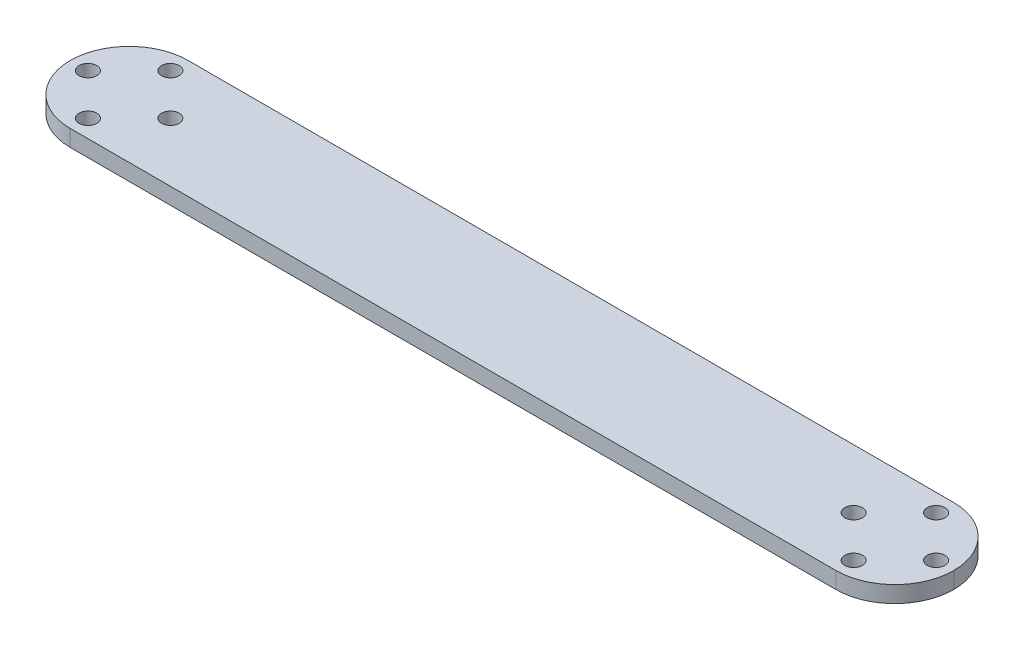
ISO-10303-21;
HEADER;
FILE_DESCRIPTION(('STEP AP214'),'2;1');
FILE_NAME('part.step','',(''),(''),'','','');
FILE_SCHEMA(('AUTOMOTIVE_DESIGN { 1 0 10303 214 1 1 1 1 }'));
ENDSEC;
DATA;
#1=APPLICATION_CONTEXT('core data for automotive mechanical design processes');
#2=APPLICATION_PROTOCOL_DEFINITION('international standard','automotive_design',2000,#1);
#3=PRODUCT_CONTEXT('',#1,'mechanical');
#4=PRODUCT('Part','Part','',(#3));
#5=PRODUCT_RELATED_PRODUCT_CATEGORY('part','',(#4));
#6=PRODUCT_DEFINITION_FORMATION('','',#4);
#7=PRODUCT_DEFINITION_CONTEXT('part definition',#1,'design');
#8=PRODUCT_DEFINITION('design','',#6,#7);
#9=PRODUCT_DEFINITION_SHAPE('','',#8);
#10=(LENGTH_UNIT() NAMED_UNIT(*) SI_UNIT(.MILLI.,.METRE.));
#11=(NAMED_UNIT(*) PLANE_ANGLE_UNIT() SI_UNIT($,.RADIAN.));
#12=(NAMED_UNIT(*) SI_UNIT($,.STERADIAN.) SOLID_ANGLE_UNIT());
#13=UNCERTAINTY_MEASURE_WITH_UNIT(LENGTH_MEASURE(1.E-05),#10,'distance_accuracy_value','');
#14=(GEOMETRIC_REPRESENTATION_CONTEXT(3) GLOBAL_UNCERTAINTY_ASSIGNED_CONTEXT((#13)) GLOBAL_UNIT_ASSIGNED_CONTEXT((#10,
#11,#12)) REPRESENTATION_CONTEXT('',''));
#15=CARTESIAN_POINT('',(0.,0.,0.));
#16=DIRECTION('',(0.,0.,1.));
#17=DIRECTION('',(1.,0.,0.));
#18=AXIS2_PLACEMENT_3D('',#15,#16,#17);
#19=CARTESIAN_POINT('',(0.,2.8,0.));
#20=DIRECTION('',(0.,0.,-1.));
#21=DIRECTION('',(-1.,0.,0.));
#22=AXIS2_PLACEMENT_3D('',#19,#20,#21);
#23=PLANE('',#22);
#24=DIRECTION('',(1.,0.,0.));
#25=VECTOR('',#24,1.);
#26=CARTESIAN_POINT('',(0.,2.8,0.));
#27=LINE('',#26,#25);
#28=CARTESIAN_POINT('',(10.,2.8,0.));
#29=VERTEX_POINT('',#28);
#30=CARTESIAN_POINT('',(140.,2.8,0.));
#31=VERTEX_POINT('',#30);
#32=EDGE_CURVE('E105',#29,#31,#27,.T.);
#33=ORIENTED_EDGE('',*,*,#32,.F.);
#34=DIRECTION('',(0.,-1.,0.));
#35=VECTOR('',#34,1.);
#36=CARTESIAN_POINT('',(10.,2.8,0.));
#37=LINE('',#36,#35);
#38=CARTESIAN_POINT('',(10.,0.,0.));
#39=VERTEX_POINT('',#38);
#40=EDGE_CURVE('E91',#29,#39,#37,.T.);
#41=ORIENTED_EDGE('',*,*,#40,.T.);
#42=DIRECTION('',(1.,0.,0.));
#43=VECTOR('',#42,1.);
#44=CARTESIAN_POINT('',(0.,0.,0.));
#45=LINE('',#44,#43);
#46=CARTESIAN_POINT('',(140.,0.,0.));
#47=VERTEX_POINT('',#46);
#48=EDGE_CURVE('E102',#39,#47,#45,.T.);
#49=ORIENTED_EDGE('',*,*,#48,.T.);
#50=DIRECTION('',(0.,-1.,0.));
#51=VECTOR('',#50,1.);
#52=CARTESIAN_POINT('',(140.,2.8,0.));
#53=LINE('',#52,#51);
#54=EDGE_CURVE('E107',#47,#31,#53,.F.);
#55=ORIENTED_EDGE('',*,*,#54,.T.);
#56=EDGE_LOOP('',(#33,#41,#49,#55));
#57=FACE_BOUND('',#56,.T.);
#58=ADVANCED_FACE('F32',(#57),#23,.F.);
#59=CARTESIAN_POINT('',(0.,2.8,-20.));
#60=DIRECTION('',(0.,0.,1.));
#61=DIRECTION('',(1.,0.,0.));
#62=AXIS2_PLACEMENT_3D('',#59,#60,#61);
#63=PLANE('',#62);
#64=DIRECTION('',(-1.,0.,0.));
#65=VECTOR('',#64,1.);
#66=CARTESIAN_POINT('',(0.,0.,-20.));
#67=LINE('',#66,#65);
#68=CARTESIAN_POINT('',(140.,0.,-20.));
#69=VERTEX_POINT('',#68);
#70=CARTESIAN_POINT('',(10.,0.,-20.));
#71=VERTEX_POINT('',#70);
#72=EDGE_CURVE('E111',#69,#71,#67,.T.);
#73=ORIENTED_EDGE('',*,*,#72,.T.);
#74=DIRECTION('',(0.,-1.,0.));
#75=VECTOR('',#74,1.);
#76=CARTESIAN_POINT('',(10.,2.8,-20.));
#77=LINE('',#76,#75);
#78=CARTESIAN_POINT('',(10.,2.8,-20.));
#79=VERTEX_POINT('',#78);
#80=EDGE_CURVE('E11',#71,#79,#77,.F.);
#81=ORIENTED_EDGE('',*,*,#80,.T.);
#82=DIRECTION('',(-1.,0.,0.));
#83=VECTOR('',#82,1.);
#84=CARTESIAN_POINT('',(0.,2.8,-20.));
#85=LINE('',#84,#83);
#86=CARTESIAN_POINT('',(140.,2.8,-20.));
#87=VERTEX_POINT('',#86);
#88=EDGE_CURVE('E115',#87,#79,#85,.T.);
#89=ORIENTED_EDGE('',*,*,#88,.F.);
#90=DIRECTION('',(0.,-1.,0.));
#91=VECTOR('',#90,1.);
#92=CARTESIAN_POINT('',(140.,2.8,-20.));
#93=LINE('',#92,#91);
#94=EDGE_CURVE('E41',#87,#69,#93,.T.);
#95=ORIENTED_EDGE('',*,*,#94,.T.);
#96=EDGE_LOOP('',(#73,#81,#89,#95));
#97=FACE_BOUND('',#96,.T.);
#98=ADVANCED_FACE('F132',(#97),#63,.F.);
#99=CARTESIAN_POINT('',(0.,2.8,0.));
#100=DIRECTION('',(0.,1.,0.));
#101=DIRECTION('',(0.,0.,1.));
#102=AXIS2_PLACEMENT_3D('',#99,#100,#101);
#103=PLANE('',#102);
#104=CARTESIAN_POINT('',(140.,2.8,-3.));
#105=DIRECTION('',(0.,-1.,0.));
#106=DIRECTION('',(0.,0.,-1.));
#107=AXIS2_PLACEMENT_3D('',#104,#105,#106);
#108=CIRCLE('',#107,1.5);
#109=CARTESIAN_POINT('',(140.,2.8,-4.5));
#110=VERTEX_POINT('',#109);
#111=EDGE_CURVE('E235',#110,#110,#108,.T.);
#112=ORIENTED_EDGE('',*,*,#111,.T.);
#113=EDGE_LOOP('',(#112));
#114=FACE_BOUND('',#113,.T.);
#115=CARTESIAN_POINT('',(10.,2.8,-17.));
#116=DIRECTION('',(0.,-1.,0.));
#117=DIRECTION('',(0.,0.,-1.));
#118=AXIS2_PLACEMENT_3D('',#115,#116,#117);
#119=CIRCLE('',#118,1.5);
#120=CARTESIAN_POINT('',(10.,2.8,-18.5));
#121=VERTEX_POINT('',#120);
#122=EDGE_CURVE('E228',#121,#121,#119,.T.);
#123=ORIENTED_EDGE('',*,*,#122,.T.);
#124=EDGE_LOOP('',(#123));
#125=FACE_BOUND('',#124,.T.);
#126=CARTESIAN_POINT('',(3.,2.8,-10.));
#127=DIRECTION('',(0.,-1.,0.));
#128=DIRECTION('',(0.,0.,-1.));
#129=AXIS2_PLACEMENT_3D('',#126,#127,#128);
#130=CIRCLE('',#129,1.5);
#131=CARTESIAN_POINT('',(3.,2.8,-11.5));
#132=VERTEX_POINT('',#131);
#133=EDGE_CURVE('E247',#132,#132,#130,.T.);
#134=ORIENTED_EDGE('',*,*,#133,.T.);
#135=EDGE_LOOP('',(#134));
#136=FACE_BOUND('',#135,.T.);
#137=CARTESIAN_POINT('',(9.9999999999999,2.8,-3.));
#138=DIRECTION('',(0.,-1.,0.));
#139=DIRECTION('',(0.,0.,-1.));
#140=AXIS2_PLACEMENT_3D('',#137,#138,#139);
#141=CIRCLE('',#140,1.5);
#142=CARTESIAN_POINT('',(9.9999999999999,2.8,-4.5));
#143=VERTEX_POINT('',#142);
#144=EDGE_CURVE('E240',#143,#143,#141,.T.);
#145=ORIENTED_EDGE('',*,*,#144,.T.);
#146=EDGE_LOOP('',(#145));
#147=FACE_BOUND('',#146,.T.);
#148=CARTESIAN_POINT('',(133.,2.8,-10.));
#149=DIRECTION('',(0.,-1.,0.));
#150=DIRECTION('',(0.,0.,-1.));
#151=AXIS2_PLACEMENT_3D('',#148,#149,#150);
#152=CIRCLE('',#151,1.5);
#153=CARTESIAN_POINT('',(133.,2.8,-11.5));
#154=VERTEX_POINT('',#153);
#155=EDGE_CURVE('E207',#154,#154,#152,.T.);
#156=ORIENTED_EDGE('',*,*,#155,.T.);
#157=EDGE_LOOP('',(#156));
#158=FACE_BOUND('',#157,.T.);
#159=CARTESIAN_POINT('',(140.,2.8,-17.));
#160=DIRECTION('',(0.,-1.,0.));
#161=DIRECTION('',(0.,0.,-1.));
#162=AXIS2_PLACEMENT_3D('',#159,#160,#161);
#163=CIRCLE('',#162,1.5);
#164=CARTESIAN_POINT('',(140.,2.8,-18.5));
#165=VERTEX_POINT('',#164);
#166=EDGE_CURVE('E212',#165,#165,#163,.T.);
#167=ORIENTED_EDGE('',*,*,#166,.T.);
#168=EDGE_LOOP('',(#167));
#169=FACE_BOUND('',#168,.T.);
#170=CARTESIAN_POINT('',(147.,2.8,-10.));
#171=DIRECTION('',(0.,-1.,0.));
#172=DIRECTION('',(0.,0.,-1.));
#173=AXIS2_PLACEMENT_3D('',#170,#171,#172);
#174=CIRCLE('',#173,1.5);
#175=CARTESIAN_POINT('',(147.,2.8,-11.5));
#176=VERTEX_POINT('',#175);
#177=EDGE_CURVE('E222',#176,#176,#174,.T.);
#178=ORIENTED_EDGE('',*,*,#177,.T.);
#179=EDGE_LOOP('',(#178));
#180=FACE_BOUND('',#179,.T.);
#181=CARTESIAN_POINT('',(17.,2.8,-10.));
#182=DIRECTION('',(0.,-1.,0.));
#183=DIRECTION('',(0.,0.,-1.));
#184=AXIS2_PLACEMENT_3D('',#181,#182,#183);
#185=CIRCLE('',#184,1.5);
#186=CARTESIAN_POINT('',(17.,2.8,-11.5));
#187=VERTEX_POINT('',#186);
#188=EDGE_CURVE('E142',#187,#187,#185,.T.);
#189=ORIENTED_EDGE('',*,*,#188,.T.);
#190=EDGE_LOOP('',(#189));
#191=FACE_BOUND('',#190,.T.);
#192=CARTESIAN_POINT('',(10.,2.8,-10.));
#193=DIRECTION('',(0.,1.,0.));
#194=DIRECTION('',(0.,0.,1.));
#195=AXIS2_PLACEMENT_3D('',#192,#193,#194);
#196=CIRCLE('',#195,10.);
#197=CARTESIAN_POINT('',(0.,2.8,-10.));
#198=VERTEX_POINT('',#197);
#199=EDGE_CURVE('E49',#79,#198,#196,.T.);
#200=ORIENTED_EDGE('',*,*,#199,.T.);
#201=CARTESIAN_POINT('',(10.,2.8,-10.));
#202=DIRECTION('',(0.,1.,0.));
#203=DIRECTION('',(0.,0.,1.));
#204=AXIS2_PLACEMENT_3D('',#201,#202,#203);
#205=CIRCLE('',#204,10.);
#206=EDGE_CURVE('E127',#198,#29,#205,.T.);
#207=ORIENTED_EDGE('',*,*,#206,.T.);
#208=ORIENTED_EDGE('',*,*,#32,.T.);
#209=CARTESIAN_POINT('',(140.,2.8,-10.));
#210=DIRECTION('',(0.,1.,0.));
#211=DIRECTION('',(0.,0.,1.));
#212=AXIS2_PLACEMENT_3D('',#209,#210,#211);
#213=CIRCLE('',#212,10.);
#214=CARTESIAN_POINT('',(150.,2.8,-10.));
#215=VERTEX_POINT('',#214);
#216=EDGE_CURVE('E96',#31,#215,#213,.T.);
#217=ORIENTED_EDGE('',*,*,#216,.T.);
#218=CARTESIAN_POINT('',(140.,2.8,-10.));
#219=DIRECTION('',(0.,1.,0.));
#220=DIRECTION('',(0.,0.,1.));
#221=AXIS2_PLACEMENT_3D('',#218,#219,#220);
#222=CIRCLE('',#221,10.);
#223=EDGE_CURVE('E124',#215,#87,#222,.T.);
#224=ORIENTED_EDGE('',*,*,#223,.T.);
#225=ORIENTED_EDGE('',*,*,#88,.T.);
#226=EDGE_LOOP('',(#200,#207,#208,#217,#224,#225));
#227=FACE_BOUND('',#226,.T.);
#228=ADVANCED_FACE('F137',(#114,#125,#136,#147,#158,#169,#180,#191,#227),#103,.T.);
#229=CARTESIAN_POINT('',(0.,0.,0.));
#230=DIRECTION('',(0.,1.,0.));
#231=DIRECTION('',(0.,0.,1.));
#232=AXIS2_PLACEMENT_3D('',#229,#230,#231);
#233=PLANE('',#232);
#234=CARTESIAN_POINT('',(140.,0.,-3.));
#235=DIRECTION('',(0.,-1.,0.));
#236=DIRECTION('',(0.,0.,-1.));
#237=AXIS2_PLACEMENT_3D('',#234,#235,#236);
#238=CIRCLE('',#237,1.5);
#239=CARTESIAN_POINT('',(140.,0.,-4.5));
#240=VERTEX_POINT('',#239);
#241=EDGE_CURVE('E214',#240,#240,#238,.T.);
#242=ORIENTED_EDGE('',*,*,#241,.F.);
#243=EDGE_LOOP('',(#242));
#244=FACE_BOUND('',#243,.T.);
#245=CARTESIAN_POINT('',(10.,0.,-17.));
#246=DIRECTION('',(0.,-1.,0.));
#247=DIRECTION('',(0.,0.,-1.));
#248=AXIS2_PLACEMENT_3D('',#245,#246,#247);
#249=CIRCLE('',#248,1.5);
#250=CARTESIAN_POINT('',(10.,0.,-18.5));
#251=VERTEX_POINT('',#250);
#252=EDGE_CURVE('E232',#251,#251,#249,.T.);
#253=ORIENTED_EDGE('',*,*,#252,.F.);
#254=EDGE_LOOP('',(#253));
#255=FACE_BOUND('',#254,.T.);
#256=CARTESIAN_POINT('',(3.,0.,-10.));
#257=DIRECTION('',(0.,-1.,0.));
#258=DIRECTION('',(0.,0.,-1.));
#259=AXIS2_PLACEMENT_3D('',#256,#257,#258);
#260=CIRCLE('',#259,1.5);
#261=CARTESIAN_POINT('',(3.,0.,-11.5));
#262=VERTEX_POINT('',#261);
#263=EDGE_CURVE('E231',#262,#262,#260,.T.);
#264=ORIENTED_EDGE('',*,*,#263,.F.);
#265=EDGE_LOOP('',(#264));
#266=FACE_BOUND('',#265,.T.);
#267=CARTESIAN_POINT('',(9.9999999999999,0.,-3.));
#268=DIRECTION('',(0.,-1.,0.));
#269=DIRECTION('',(0.,0.,-1.));
#270=AXIS2_PLACEMENT_3D('',#267,#268,#269);
#271=CIRCLE('',#270,1.5);
#272=CARTESIAN_POINT('',(9.9999999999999,0.,-4.5));
#273=VERTEX_POINT('',#272);
#274=EDGE_CURVE('E244',#273,#273,#271,.T.);
#275=ORIENTED_EDGE('',*,*,#274,.F.);
#276=EDGE_LOOP('',(#275));
#277=FACE_BOUND('',#276,.T.);
#278=CARTESIAN_POINT('',(133.,0.,-10.));
#279=DIRECTION('',(0.,-1.,0.));
#280=DIRECTION('',(0.,0.,-1.));
#281=AXIS2_PLACEMENT_3D('',#278,#279,#280);
#282=CIRCLE('',#281,1.5);
#283=CARTESIAN_POINT('',(133.,0.,-11.5));
#284=VERTEX_POINT('',#283);
#285=EDGE_CURVE('E210',#284,#284,#282,.T.);
#286=ORIENTED_EDGE('',*,*,#285,.F.);
#287=EDGE_LOOP('',(#286));
#288=FACE_BOUND('',#287,.T.);
#289=CARTESIAN_POINT('',(140.,0.,-17.));
#290=DIRECTION('',(0.,-1.,0.));
#291=DIRECTION('',(0.,0.,-1.));
#292=AXIS2_PLACEMENT_3D('',#289,#290,#291);
#293=CIRCLE('',#292,1.5);
#294=CARTESIAN_POINT('',(140.,0.,-18.5));
#295=VERTEX_POINT('',#294);
#296=EDGE_CURVE('E217',#295,#295,#293,.T.);
#297=ORIENTED_EDGE('',*,*,#296,.F.);
#298=EDGE_LOOP('',(#297));
#299=FACE_BOUND('',#298,.T.);
#300=CARTESIAN_POINT('',(147.,0.,-10.));
#301=DIRECTION('',(0.,-1.,0.));
#302=DIRECTION('',(0.,0.,-1.));
#303=AXIS2_PLACEMENT_3D('',#300,#301,#302);
#304=CIRCLE('',#303,1.5);
#305=CARTESIAN_POINT('',(147.,0.,-11.5));
#306=VERTEX_POINT('',#305);
#307=EDGE_CURVE('E225',#306,#306,#304,.T.);
#308=ORIENTED_EDGE('',*,*,#307,.F.);
#309=EDGE_LOOP('',(#308));
#310=FACE_BOUND('',#309,.T.);
#311=CARTESIAN_POINT('',(17.,0.,-10.));
#312=DIRECTION('',(0.,-1.,0.));
#313=DIRECTION('',(0.,0.,-1.));
#314=AXIS2_PLACEMENT_3D('',#311,#312,#313);
#315=CIRCLE('',#314,1.5);
#316=CARTESIAN_POINT('',(17.,0.,-11.5));
#317=VERTEX_POINT('',#316);
#318=EDGE_CURVE('E243',#317,#317,#315,.T.);
#319=ORIENTED_EDGE('',*,*,#318,.F.);
#320=EDGE_LOOP('',(#319));
#321=FACE_BOUND('',#320,.T.);
#322=ORIENTED_EDGE('',*,*,#48,.F.);
#323=CARTESIAN_POINT('',(10.,0.,-10.));
#324=DIRECTION('',(0.,1.,0.));
#325=DIRECTION('',(0.,0.,1.));
#326=AXIS2_PLACEMENT_3D('',#323,#324,#325);
#327=CIRCLE('',#326,10.);
#328=CARTESIAN_POINT('',(0.,0.,-10.));
#329=VERTEX_POINT('',#328);
#330=EDGE_CURVE('E87',#39,#329,#327,.F.);
#331=ORIENTED_EDGE('',*,*,#330,.T.);
#332=CARTESIAN_POINT('',(10.,0.,-10.));
#333=DIRECTION('',(0.,1.,0.));
#334=DIRECTION('',(0.,0.,1.));
#335=AXIS2_PLACEMENT_3D('',#332,#333,#334);
#336=CIRCLE('',#335,10.);
#337=EDGE_CURVE('E97',#329,#71,#336,.F.);
#338=ORIENTED_EDGE('',*,*,#337,.T.);
#339=ORIENTED_EDGE('',*,*,#72,.F.);
#340=CARTESIAN_POINT('',(140.,0.,-10.));
#341=DIRECTION('',(0.,1.,0.));
#342=DIRECTION('',(0.,0.,1.));
#343=AXIS2_PLACEMENT_3D('',#340,#341,#342);
#344=CIRCLE('',#343,10.);
#345=CARTESIAN_POINT('',(150.,0.,-10.));
#346=VERTEX_POINT('',#345);
#347=EDGE_CURVE('E120',#69,#346,#344,.F.);
#348=ORIENTED_EDGE('',*,*,#347,.T.);
#349=CARTESIAN_POINT('',(140.,0.,-10.));
#350=DIRECTION('',(0.,1.,0.));
#351=DIRECTION('',(0.,0.,1.));
#352=AXIS2_PLACEMENT_3D('',#349,#350,#351);
#353=CIRCLE('',#352,10.);
#354=EDGE_CURVE('E106',#346,#47,#353,.F.);
#355=ORIENTED_EDGE('',*,*,#354,.T.);
#356=EDGE_LOOP('',(#322,#331,#338,#339,#348,#355));
#357=FACE_BOUND('',#356,.T.);
#358=ADVANCED_FACE('F109',(#244,#255,#266,#277,#288,#299,#310,#321,#357),#233,.F.);
#359=CARTESIAN_POINT('',(10.,2.8,-10.));
#360=DIRECTION('',(0.,-1.,0.));
#361=DIRECTION('',(0.,0.,-1.));
#362=AXIS2_PLACEMENT_3D('',#359,#360,#361);
#363=CYLINDRICAL_SURFACE('',#362,10.);
#364=DIRECTION('',(0.,-1.,0.));
#365=VECTOR('',#364,1.);
#366=CARTESIAN_POINT('',(0.,2.8,-10.));
#367=LINE('',#366,#365);
#368=EDGE_CURVE('E92',#198,#329,#367,.T.);
#369=ORIENTED_EDGE('',*,*,#368,.F.);
#370=ORIENTED_EDGE('',*,*,#199,.F.);
#371=ORIENTED_EDGE('',*,*,#80,.F.);
#372=ORIENTED_EDGE('',*,*,#337,.F.);
#373=EDGE_LOOP('',(#369,#370,#371,#372));
#374=FACE_BOUND('',#373,.T.);
#375=ADVANCED_FACE('F136',(#374),#363,.T.);
#376=CARTESIAN_POINT('',(10.,2.8,-10.));
#377=DIRECTION('',(0.,-1.,0.));
#378=DIRECTION('',(0.,0.,-1.));
#379=AXIS2_PLACEMENT_3D('',#376,#377,#378);
#380=CYLINDRICAL_SURFACE('',#379,10.);
#381=ORIENTED_EDGE('',*,*,#206,.F.);
#382=ORIENTED_EDGE('',*,*,#368,.T.);
#383=ORIENTED_EDGE('',*,*,#330,.F.);
#384=ORIENTED_EDGE('',*,*,#40,.F.);
#385=EDGE_LOOP('',(#381,#382,#383,#384));
#386=FACE_BOUND('',#385,.T.);
#387=ADVANCED_FACE('F90',(#386),#380,.T.);
#388=CARTESIAN_POINT('',(140.,2.8,-10.));
#389=DIRECTION('',(0.,-1.,0.));
#390=DIRECTION('',(0.,0.,-1.));
#391=AXIS2_PLACEMENT_3D('',#388,#389,#390);
#392=CYLINDRICAL_SURFACE('',#391,10.);
#393=DIRECTION('',(0.,-1.,0.));
#394=VECTOR('',#393,1.);
#395=CARTESIAN_POINT('',(150.,2.8,-10.));
#396=LINE('',#395,#394);
#397=EDGE_CURVE('E36',#215,#346,#396,.T.);
#398=ORIENTED_EDGE('',*,*,#397,.F.);
#399=ORIENTED_EDGE('',*,*,#216,.F.);
#400=ORIENTED_EDGE('',*,*,#54,.F.);
#401=ORIENTED_EDGE('',*,*,#354,.F.);
#402=EDGE_LOOP('',(#398,#399,#400,#401));
#403=FACE_BOUND('',#402,.T.);
#404=ADVANCED_FACE('F34',(#403),#392,.T.);
#405=CARTESIAN_POINT('',(140.,2.8,-10.));
#406=DIRECTION('',(0.,-1.,0.));
#407=DIRECTION('',(0.,0.,-1.));
#408=AXIS2_PLACEMENT_3D('',#405,#406,#407);
#409=CYLINDRICAL_SURFACE('',#408,10.);
#410=ORIENTED_EDGE('',*,*,#223,.F.);
#411=ORIENTED_EDGE('',*,*,#397,.T.);
#412=ORIENTED_EDGE('',*,*,#347,.F.);
#413=ORIENTED_EDGE('',*,*,#94,.F.);
#414=EDGE_LOOP('',(#410,#411,#412,#413));
#415=FACE_BOUND('',#414,.T.);
#416=ADVANCED_FACE('F143',(#415),#409,.T.);
#417=CARTESIAN_POINT('',(17.,2.8,-10.));
#418=DIRECTION('',(0.,-1.,0.));
#419=DIRECTION('',(0.,0.,-1.));
#420=AXIS2_PLACEMENT_3D('',#417,#418,#419);
#421=CYLINDRICAL_SURFACE('',#420,1.5);
#422=ORIENTED_EDGE('',*,*,#188,.F.);
#423=EDGE_LOOP('',(#422));
#424=FACE_BOUND('',#423,.T.);
#425=ORIENTED_EDGE('',*,*,#318,.T.);
#426=EDGE_LOOP('',(#425));
#427=FACE_BOUND('',#426,.T.);
#428=ADVANCED_FACE('F145',(#424,#427),#421,.F.);
#429=CARTESIAN_POINT('',(147.,2.8,-10.));
#430=DIRECTION('',(0.,-1.,0.));
#431=DIRECTION('',(0.,0.,-1.));
#432=AXIS2_PLACEMENT_3D('',#429,#430,#431);
#433=CYLINDRICAL_SURFACE('',#432,1.5);
#434=ORIENTED_EDGE('',*,*,#177,.F.);
#435=EDGE_LOOP('',(#434));
#436=FACE_BOUND('',#435,.T.);
#437=ORIENTED_EDGE('',*,*,#307,.T.);
#438=EDGE_LOOP('',(#437));
#439=FACE_BOUND('',#438,.T.);
#440=ADVANCED_FACE('F150',(#436,#439),#433,.F.);
#441=CARTESIAN_POINT('',(140.,2.8,-17.));
#442=DIRECTION('',(0.,-1.,0.));
#443=DIRECTION('',(0.,0.,-1.));
#444=AXIS2_PLACEMENT_3D('',#441,#442,#443);
#445=CYLINDRICAL_SURFACE('',#444,1.5);
#446=ORIENTED_EDGE('',*,*,#166,.F.);
#447=EDGE_LOOP('',(#446));
#448=FACE_BOUND('',#447,.T.);
#449=ORIENTED_EDGE('',*,*,#296,.T.);
#450=EDGE_LOOP('',(#449));
#451=FACE_BOUND('',#450,.T.);
#452=ADVANCED_FACE('F195',(#448,#451),#445,.F.);
#453=CARTESIAN_POINT('',(133.,2.8,-10.));
#454=DIRECTION('',(0.,-1.,0.));
#455=DIRECTION('',(0.,0.,-1.));
#456=AXIS2_PLACEMENT_3D('',#453,#454,#455);
#457=CYLINDRICAL_SURFACE('',#456,1.5);
#458=ORIENTED_EDGE('',*,*,#155,.F.);
#459=EDGE_LOOP('',(#458));
#460=FACE_BOUND('',#459,.T.);
#461=ORIENTED_EDGE('',*,*,#285,.T.);
#462=EDGE_LOOP('',(#461));
#463=FACE_BOUND('',#462,.T.);
#464=ADVANCED_FACE('F184',(#460,#463),#457,.F.);
#465=CARTESIAN_POINT('',(9.9999999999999,2.8,-3.));
#466=DIRECTION('',(0.,-1.,0.));
#467=DIRECTION('',(0.,0.,-1.));
#468=AXIS2_PLACEMENT_3D('',#465,#466,#467);
#469=CYLINDRICAL_SURFACE('',#468,1.5);
#470=ORIENTED_EDGE('',*,*,#144,.F.);
#471=EDGE_LOOP('',(#470));
#472=FACE_BOUND('',#471,.T.);
#473=ORIENTED_EDGE('',*,*,#274,.T.);
#474=EDGE_LOOP('',(#473));
#475=FACE_BOUND('',#474,.T.);
#476=ADVANCED_FACE('F180',(#472,#475),#469,.F.);
#477=CARTESIAN_POINT('',(3.,2.8,-10.));
#478=DIRECTION('',(0.,-1.,0.));
#479=DIRECTION('',(0.,0.,-1.));
#480=AXIS2_PLACEMENT_3D('',#477,#478,#479);
#481=CYLINDRICAL_SURFACE('',#480,1.5);
#482=ORIENTED_EDGE('',*,*,#133,.F.);
#483=EDGE_LOOP('',(#482));
#484=FACE_BOUND('',#483,.T.);
#485=ORIENTED_EDGE('',*,*,#263,.T.);
#486=EDGE_LOOP('',(#485));
#487=FACE_BOUND('',#486,.T.);
#488=ADVANCED_FACE('F176',(#484,#487),#481,.F.);
#489=CARTESIAN_POINT('',(10.,2.8,-17.));
#490=DIRECTION('',(0.,-1.,0.));
#491=DIRECTION('',(0.,0.,-1.));
#492=AXIS2_PLACEMENT_3D('',#489,#490,#491);
#493=CYLINDRICAL_SURFACE('',#492,1.5);
#494=ORIENTED_EDGE('',*,*,#122,.F.);
#495=EDGE_LOOP('',(#494));
#496=FACE_BOUND('',#495,.T.);
#497=ORIENTED_EDGE('',*,*,#252,.T.);
#498=EDGE_LOOP('',(#497));
#499=FACE_BOUND('',#498,.T.);
#500=ADVANCED_FACE('F179',(#496,#499),#493,.F.);
#501=CARTESIAN_POINT('',(140.,2.8,-3.));
#502=DIRECTION('',(0.,-1.,0.));
#503=DIRECTION('',(0.,0.,-1.));
#504=AXIS2_PLACEMENT_3D('',#501,#502,#503);
#505=CYLINDRICAL_SURFACE('',#504,1.5);
#506=ORIENTED_EDGE('',*,*,#111,.F.);
#507=EDGE_LOOP('',(#506));
#508=FACE_BOUND('',#507,.T.);
#509=ORIENTED_EDGE('',*,*,#241,.T.);
#510=EDGE_LOOP('',(#509));
#511=FACE_BOUND('',#510,.T.);
#512=ADVANCED_FACE('F186',(#508,#511),#505,.F.);
#513=CLOSED_SHELL('',(#58,#98,#228,#358,#375,#387,#404,#416,#428,#440,#452,#464,#476,#488,#500,#512));
#514=MANIFOLD_SOLID_BREP('B2',#513);
#515=ADVANCED_BREP_SHAPE_REPRESENTATION('',(#18,#514),#14);
#516=SHAPE_DEFINITION_REPRESENTATION(#9,#515);
ENDSEC;
END-ISO-10303-21;
